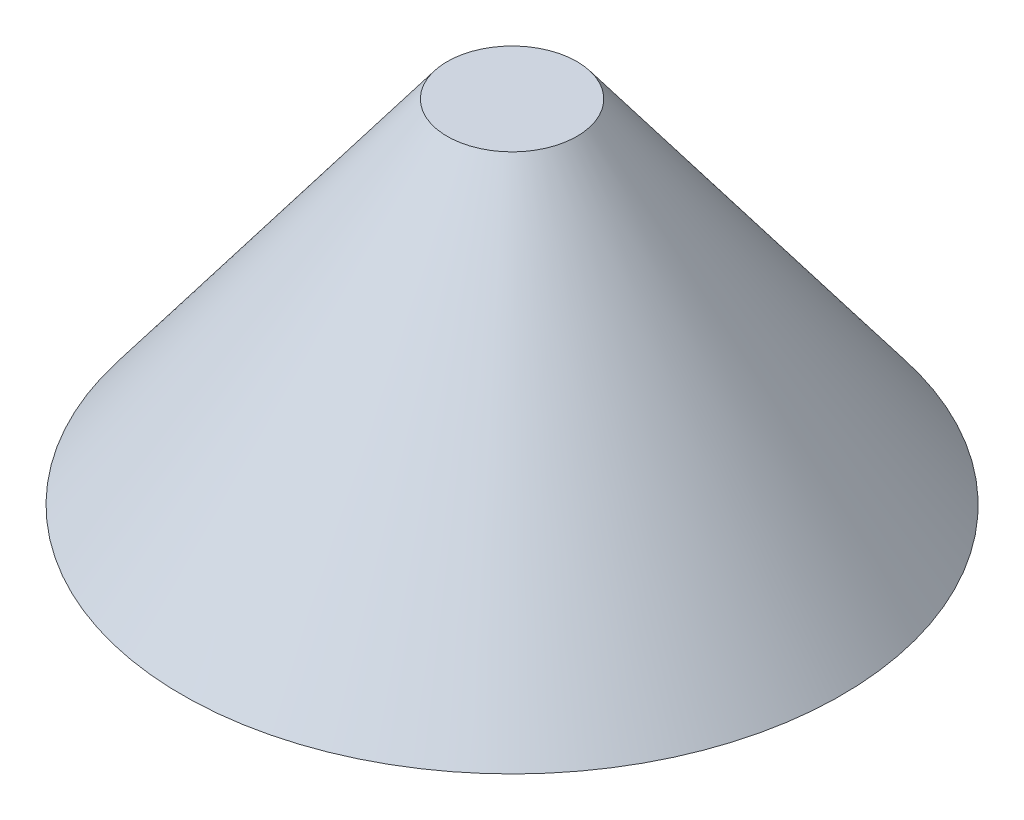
from build123d import *


with BuildPart() as part:
    # Sketch1 → Revolve1 (revolve)
    with BuildSketch(Plane.XY, mode=Mode.PRIVATE) as revolve1_sk:
        Polygon((0, 0), (95.348351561, 0), (18.76704885, 101.707369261), (0, 101.707369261), align=None)
    revolve(revolve1_sk.sketch.rotate(Axis((0, 101.707369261, 0), (0, -1, 0)), 270), axis=Axis((0, 101.707369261, 0), (0, -1, 0)))


solid = part.part
